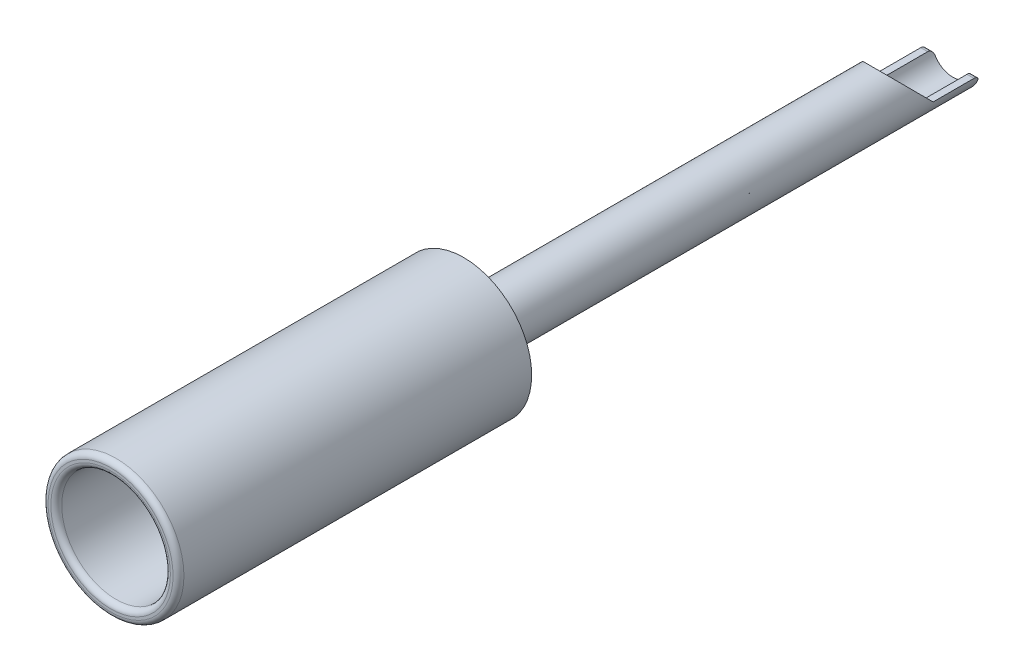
ISO-10303-21;
HEADER;
FILE_DESCRIPTION(('STEP AP214'),'2;1');
FILE_NAME('part.step','',(''),(''),'','','');
FILE_SCHEMA(('AUTOMOTIVE_DESIGN { 1 0 10303 214 1 1 1 1 }'));
ENDSEC;
DATA;
#1=APPLICATION_CONTEXT('core data for automotive mechanical design processes');
#2=APPLICATION_PROTOCOL_DEFINITION('international standard','automotive_design',2000,#1);
#3=PRODUCT_CONTEXT('',#1,'mechanical');
#4=PRODUCT('Part','Part','',(#3));
#5=PRODUCT_RELATED_PRODUCT_CATEGORY('part','',(#4));
#6=PRODUCT_DEFINITION_FORMATION('','',#4);
#7=PRODUCT_DEFINITION_CONTEXT('part definition',#1,'design');
#8=PRODUCT_DEFINITION('design','',#6,#7);
#9=PRODUCT_DEFINITION_SHAPE('','',#8);
#10=(LENGTH_UNIT() NAMED_UNIT(*) SI_UNIT(.MILLI.,.METRE.));
#11=(NAMED_UNIT(*) PLANE_ANGLE_UNIT() SI_UNIT($,.RADIAN.));
#12=(NAMED_UNIT(*) SI_UNIT($,.STERADIAN.) SOLID_ANGLE_UNIT());
#13=UNCERTAINTY_MEASURE_WITH_UNIT(LENGTH_MEASURE(1.E-05),#10,'distance_accuracy_value','');
#14=(GEOMETRIC_REPRESENTATION_CONTEXT(3) GLOBAL_UNCERTAINTY_ASSIGNED_CONTEXT((#13)) GLOBAL_UNIT_ASSIGNED_CONTEXT((#10,
#11,#12)) REPRESENTATION_CONTEXT('',''));
#15=CARTESIAN_POINT('',(0.,0.,0.));
#16=DIRECTION('',(0.,0.,1.));
#17=DIRECTION('',(1.,0.,0.));
#18=AXIS2_PLACEMENT_3D('',#15,#16,#17);
#19=CARTESIAN_POINT('',(0.,0.,0.));
#20=DIRECTION('',(0.,0.,-1.));
#21=DIRECTION('',(-1.,0.,0.));
#22=AXIS2_PLACEMENT_3D('',#19,#20,#21);
#23=CYLINDRICAL_SURFACE('',#22,0.5);
#24=CARTESIAN_POINT('',(0.,0.,-12.));
#25=DIRECTION('',(0.,0.,1.));
#26=DIRECTION('',(1.,0.,0.));
#27=AXIS2_PLACEMENT_3D('',#24,#25,#26);
#28=CIRCLE('',#27,0.5);
#29=CARTESIAN_POINT('',(0.5,0.,-12.));
#30=VERTEX_POINT('',#29);
#31=EDGE_CURVE('E118',#30,#30,#28,.T.);
#32=ORIENTED_EDGE('',*,*,#31,.T.);
#33=EDGE_LOOP('',(#32));
#34=FACE_BOUND('',#33,.T.);
#35=CARTESIAN_POINT('',(0.,0.,-28.));
#36=DIRECTION('',(0.,0.,-1.));
#37=DIRECTION('',(-1.,0.,0.));
#38=AXIS2_PLACEMENT_3D('',#35,#36,#37);
#39=CIRCLE('',#38,0.5);
#40=CARTESIAN_POINT('',(-0.5,0.,-28.));
#41=VERTEX_POINT('',#40);
#42=EDGE_CURVE('E115',#41,#41,#39,.F.);
#43=ORIENTED_EDGE('',*,*,#42,.F.);
#44=EDGE_LOOP('',(#43));
#45=FACE_BOUND('',#44,.T.);
#46=ADVANCED_FACE('F36',(#34,#45),#23,.F.);
#47=CARTESIAN_POINT('',(0.,0.,-31.));
#48=DIRECTION('',(0.,0.,1.));
#49=DIRECTION('',(1.,0.,0.));
#50=AXIS2_PLACEMENT_3D('',#47,#48,#49);
#51=CYLINDRICAL_SURFACE('',#50,2.5);
#52=CARTESIAN_POINT('',(0.,0.,-0.199999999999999));
#53=DIRECTION('',(0.,0.,1.));
#54=DIRECTION('',(1.,0.,0.));
#55=AXIS2_PLACEMENT_3D('',#52,#53,#54);
#56=CIRCLE('',#55,2.5);
#57=CARTESIAN_POINT('',(2.5,0.,-0.199999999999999));
#58=VERTEX_POINT('',#57);
#59=EDGE_CURVE('E141',#58,#58,#56,.F.);
#60=ORIENTED_EDGE('',*,*,#59,.T.);
#61=EDGE_LOOP('',(#60));
#62=FACE_BOUND('',#61,.T.);
#63=CARTESIAN_POINT('',(0.,0.,-13.));
#64=DIRECTION('',(0.,0.,-1.));
#65=DIRECTION('',(-1.,0.,0.));
#66=AXIS2_PLACEMENT_3D('',#63,#64,#65);
#67=CIRCLE('',#66,2.5);
#68=CARTESIAN_POINT('',(-2.5,0.,-13.));
#69=VERTEX_POINT('',#68);
#70=EDGE_CURVE('E125',#69,#69,#67,.F.);
#71=ORIENTED_EDGE('',*,*,#70,.T.);
#72=EDGE_LOOP('',(#71));
#73=FACE_BOUND('',#72,.T.);
#74=ADVANCED_FACE('F182',(#62,#73),#51,.T.);
#75=CARTESIAN_POINT('',(0.,0.,0.));
#76=DIRECTION('',(0.,0.,1.));
#77=DIRECTION('',(1.,0.,0.));
#78=AXIS2_PLACEMENT_3D('',#75,#76,#77);
#79=PLANE('',#78);
#80=CARTESIAN_POINT('',(0.,0.,0.));
#81=DIRECTION('',(0.,0.,1.));
#82=DIRECTION('',(1.,0.,0.));
#83=AXIS2_PLACEMENT_3D('',#80,#81,#82);
#84=CIRCLE('',#83,2.3);
#85=CARTESIAN_POINT('',(2.3,0.,0.));
#86=VERTEX_POINT('',#85);
#87=EDGE_CURVE('E138',#86,#86,#84,.T.);
#88=ORIENTED_EDGE('',*,*,#87,.T.);
#89=EDGE_LOOP('',(#88));
#90=FACE_BOUND('',#89,.T.);
#91=CARTESIAN_POINT('',(0.,0.,0.));
#92=DIRECTION('',(0.,0.,1.));
#93=DIRECTION('',(1.,0.,0.));
#94=AXIS2_PLACEMENT_3D('',#91,#92,#93);
#95=CIRCLE('',#94,2.2);
#96=CARTESIAN_POINT('',(2.2,0.,0.));
#97=VERTEX_POINT('',#96);
#98=EDGE_CURVE('E131',#97,#97,#95,.F.);
#99=ORIENTED_EDGE('',*,*,#98,.T.);
#100=EDGE_LOOP('',(#99));
#101=FACE_BOUND('',#100,.T.);
#102=ADVANCED_FACE('F214',(#90,#101),#79,.T.);
#103=CARTESIAN_POINT('',(0.,0.,-12.));
#104=DIRECTION('',(0.,0.,1.));
#105=DIRECTION('',(1.,0.,0.));
#106=AXIS2_PLACEMENT_3D('',#103,#104,#105);
#107=CYLINDRICAL_SURFACE('',#106,2.);
#108=CARTESIAN_POINT('',(0.,0.,-0.200000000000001));
#109=DIRECTION('',(0.,0.,1.));
#110=DIRECTION('',(1.,0.,0.));
#111=AXIS2_PLACEMENT_3D('',#108,#109,#110);
#112=CIRCLE('',#111,2.);
#113=CARTESIAN_POINT('',(2.,0.,-0.200000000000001));
#114=VERTEX_POINT('',#113);
#115=EDGE_CURVE('E144',#114,#114,#112,.T.);
#116=ORIENTED_EDGE('',*,*,#115,.T.);
#117=EDGE_LOOP('',(#116));
#118=FACE_BOUND('',#117,.T.);
#119=CARTESIAN_POINT('',(0.,0.,-12.));
#120=DIRECTION('',(0.,0.,1.));
#121=DIRECTION('',(1.,0.,0.));
#122=AXIS2_PLACEMENT_3D('',#119,#120,#121);
#123=CIRCLE('',#122,2.);
#124=CARTESIAN_POINT('',(2.,0.,-12.));
#125=VERTEX_POINT('',#124);
#126=EDGE_CURVE('E128',#125,#125,#123,.T.);
#127=ORIENTED_EDGE('',*,*,#126,.F.);
#128=EDGE_LOOP('',(#127));
#129=FACE_BOUND('',#128,.T.);
#130=ADVANCED_FACE('F218',(#118,#129),#107,.F.);
#131=CARTESIAN_POINT('',(0.,0.,-12.));
#132=DIRECTION('',(0.,0.,1.));
#133=DIRECTION('',(1.,0.,0.));
#134=AXIS2_PLACEMENT_3D('',#131,#132,#133);
#135=PLANE('',#134);
#136=ORIENTED_EDGE('',*,*,#31,.F.);
#137=EDGE_LOOP('',(#136));
#138=FACE_BOUND('',#137,.T.);
#139=ORIENTED_EDGE('',*,*,#126,.T.);
#140=EDGE_LOOP('',(#139));
#141=FACE_BOUND('',#140,.T.);
#142=ADVANCED_FACE('F224',(#138,#141),#135,.T.);
#143=CARTESIAN_POINT('',(0.,0.,-13.));
#144=DIRECTION('',(0.,0.,-1.));
#145=DIRECTION('',(-1.,0.,0.));
#146=AXIS2_PLACEMENT_3D('',#143,#144,#145);
#147=PLANE('',#146);
#148=ORIENTED_EDGE('',*,*,#70,.F.);
#149=EDGE_LOOP('',(#148));
#150=FACE_BOUND('',#149,.T.);
#151=CARTESIAN_POINT('',(0.,0.,-13.));
#152=DIRECTION('',(0.,0.,-1.));
#153=DIRECTION('',(-1.,0.,0.));
#154=AXIS2_PLACEMENT_3D('',#151,#152,#153);
#155=CIRCLE('',#154,1.);
#156=CARTESIAN_POINT('',(-1.,0.,-13.));
#157=VERTEX_POINT('',#156);
#158=EDGE_CURVE('E122',#157,#157,#155,.T.);
#159=ORIENTED_EDGE('',*,*,#158,.F.);
#160=EDGE_LOOP('',(#159));
#161=FACE_BOUND('',#160,.T.);
#162=ADVANCED_FACE('F188',(#150,#161),#147,.T.);
#163=CARTESIAN_POINT('',(0.,0.,-13.));
#164=DIRECTION('',(0.,0.,-1.));
#165=DIRECTION('',(-1.,0.,0.));
#166=AXIS2_PLACEMENT_3D('',#163,#164,#165);
#167=CYLINDRICAL_SURFACE('',#166,1.);
#168=DIRECTION('',(0.,0.,-1.));
#169=VECTOR('',#168,1.);
#170=CARTESIAN_POINT('',(-0.979795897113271,-0.2,-13.));
#171=LINE('',#170,#169);
#172=CARTESIAN_POINT('',(-0.979795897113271,-0.2,-30.8));
#173=VERTEX_POINT('',#172);
#174=CARTESIAN_POINT('',(-0.979795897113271,-0.2,-29.3));
#175=VERTEX_POINT('',#174);
#176=EDGE_CURVE('E89',#173,#175,#171,.F.);
#177=ORIENTED_EDGE('',*,*,#176,.F.);
#178=CARTESIAN_POINT('',(-0.979795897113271,-0.2,-30.8));
#179=CARTESIAN_POINT('',(-0.979792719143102,-0.199989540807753,-30.8110328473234));
#180=CARTESIAN_POINT('',(-0.979609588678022,-0.200912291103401,-30.822062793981));
#181=CARTESIAN_POINT('',(-0.97885983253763,-0.204547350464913,-30.8438000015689));
#182=CARTESIAN_POINT('',(-0.978293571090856,-0.207257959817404,-30.8545075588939));
#183=CARTESIAN_POINT('',(-0.976753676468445,-0.214393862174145,-30.8753102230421));
#184=CARTESIAN_POINT('',(-0.975779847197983,-0.218819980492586,-30.8854050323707));
#185=CARTESIAN_POINT('',(-0.973385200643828,-0.229237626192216,-30.9046911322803));
#186=CARTESIAN_POINT('',(-0.971964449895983,-0.235228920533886,-30.9138825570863));
#187=CARTESIAN_POINT('',(-0.968633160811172,-0.248590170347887,-30.9311268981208));
#188=CARTESIAN_POINT('',(-0.966721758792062,-0.255962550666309,-30.9391777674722));
#189=CARTESIAN_POINT('',(-0.962380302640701,-0.271830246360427,-30.9539147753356));
#190=CARTESIAN_POINT('',(-0.959950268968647,-0.280325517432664,-30.9606009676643));
#191=CARTESIAN_POINT('',(-0.954522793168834,-0.298287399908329,-30.9725473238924));
#192=CARTESIAN_POINT('',(-0.951517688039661,-0.307766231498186,-30.9777855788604));
#193=CARTESIAN_POINT('',(-0.944978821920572,-0.327293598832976,-30.9866245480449));
#194=CARTESIAN_POINT('',(-0.941444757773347,-0.337342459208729,-30.9902243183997));
#195=CARTESIAN_POINT('',(-0.934458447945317,-0.356191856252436,-30.9953499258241));
#196=CARTESIAN_POINT('',(-0.931072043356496,-0.364956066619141,-30.9971044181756));
#197=CARTESIAN_POINT('',(-0.924004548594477,-0.382500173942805,-30.9994295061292));
#198=CARTESIAN_POINT('',(-0.920324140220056,-0.391279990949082,-31.0000027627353));
#199=CARTESIAN_POINT('',(-0.916515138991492,-0.400000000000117,-31.));
#200=B_SPLINE_CURVE_WITH_KNOTS('',3,(#178,#179,#180,#181,#182,#183,#184,#185,#186,#187,#188,
#189,#190,#191,#192,#193,#194,#195,#196,#197,#198,#199),.UNSPECIFIED.,.F.,.F.,(4,2,2,2,2,2,2,2,
2,2,4),(0.,0.0330543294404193,0.0660772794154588,0.0991161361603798,0.132150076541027,
0.165242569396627,0.19833375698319,0.231901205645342,0.265487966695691,0.294085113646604,
0.32261776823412),.UNSPECIFIED.);
#201=CARTESIAN_POINT('',(-0.916515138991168,-0.4,-31.));
#202=VERTEX_POINT('',#201);
#203=EDGE_CURVE('E45',#173,#202,#200,.T.);
#204=ORIENTED_EDGE('',*,*,#203,.T.);
#205=CARTESIAN_POINT('',(0.,0.,-31.));
#206=DIRECTION('',(0.,0.,-1.));
#207=DIRECTION('',(-1.,0.,0.));
#208=AXIS2_PLACEMENT_3D('',#205,#206,#207);
#209=CIRCLE('',#208,1.);
#210=CARTESIAN_POINT('',(0.916515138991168,-0.4,-31.));
#211=VERTEX_POINT('',#210);
#212=EDGE_CURVE('E121',#211,#202,#209,.T.);
#213=ORIENTED_EDGE('',*,*,#212,.F.);
#214=CARTESIAN_POINT('',(0.916515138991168,-0.4,-31.));
#215=CARTESIAN_POINT('',(0.921407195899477,-0.388812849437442,-31.0000102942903));
#216=CARTESIAN_POINT('',(0.926083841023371,-0.377516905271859,-30.9990611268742));
#217=CARTESIAN_POINT('',(0.934929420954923,-0.355033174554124,-30.9952109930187));
#218=CARTESIAN_POINT('',(0.939097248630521,-0.343845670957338,-30.9923058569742));
#219=CARTESIAN_POINT('',(0.946837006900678,-0.321926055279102,-30.9845001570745));
#220=CARTESIAN_POINT('',(0.950407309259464,-0.311195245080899,-30.9795942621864));
#221=CARTESIAN_POINT('',(0.956894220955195,-0.290636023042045,-30.9678667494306));
#222=CARTESIAN_POINT('',(0.959811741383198,-0.28080636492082,-30.9610478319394));
#223=CARTESIAN_POINT('',(0.964850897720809,-0.26295275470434,-30.9461020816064));
#224=CARTESIAN_POINT('',(0.96700846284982,-0.254857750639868,-30.9380721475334));
#225=CARTESIAN_POINT('',(0.970778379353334,-0.24009896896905,-30.9206721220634));
#226=CARTESIAN_POINT('',(0.972390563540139,-0.233435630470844,-30.9113016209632));
#227=CARTESIAN_POINT('',(0.975063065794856,-0.222003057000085,-30.8918674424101));
#228=CARTESIAN_POINT('',(0.976141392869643,-0.217173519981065,-30.8818415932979));
#229=CARTESIAN_POINT('',(0.977873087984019,-0.209238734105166,-30.8610996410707));
#230=CARTESIAN_POINT('',(0.978526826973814,-0.206131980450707,-30.8503841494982));
#231=CARTESIAN_POINT('',(0.979256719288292,-0.202627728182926,-30.832988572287));
#232=CARTESIAN_POINT('',(0.979459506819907,-0.201642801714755,-30.8264262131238));
#233=CARTESIAN_POINT('',(0.979728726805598,-0.200329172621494,-30.8132435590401));
#234=CARTESIAN_POINT('',(0.979795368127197,-0.199999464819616,-30.8066233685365));
#235=CARTESIAN_POINT('',(0.979795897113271,-0.2,-30.8));
#236=B_SPLINE_CURVE_WITH_KNOTS('',3,(#214,#215,#216,#217,#218,#219,#220,#221,#222,#223,#224,
#225,#226,#227,#228,#229,#230,#231,#232,#233,#234,#235),.UNSPECIFIED.,.F.,.F.,(4,2,2,2,2,2,2,2,
2,2,4),(0.,0.0366112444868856,0.0733007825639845,0.110088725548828,0.146824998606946,
0.181463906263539,0.216113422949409,0.249497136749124,0.282851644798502,0.302737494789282,
0.32259281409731),.UNSPECIFIED.);
#237=CARTESIAN_POINT('',(0.979795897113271,-0.2,-30.8));
#238=VERTEX_POINT('',#237);
#239=EDGE_CURVE('E52',#211,#238,#236,.T.);
#240=ORIENTED_EDGE('',*,*,#239,.T.);
#241=DIRECTION('',(0.,0.,-1.));
#242=VECTOR('',#241,1.);
#243=CARTESIAN_POINT('',(0.979795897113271,-0.2,-13.));
#244=LINE('',#243,#242);
#245=CARTESIAN_POINT('',(0.979795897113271,-0.2,-29.3));
#246=VERTEX_POINT('',#245);
#247=EDGE_CURVE('E96',#246,#238,#244,.T.);
#248=ORIENTED_EDGE('',*,*,#247,.F.);
#249=CARTESIAN_POINT('',(0.,0.,-29.1));
#250=DIRECTION('',(0.,-0.707106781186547,0.707106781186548));
#251=DIRECTION('',(0.,-0.707106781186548,-0.707106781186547));
#252=AXIS2_PLACEMENT_3D('',#249,#250,#251);
#253=ELLIPSE('',#252,1.41421356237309,1.);
#254=EDGE_CURVE('E101',#175,#246,#253,.F.);
#255=ORIENTED_EDGE('',*,*,#254,.F.);
#256=EDGE_LOOP('',(#177,#204,#213,#240,#248,#255));
#257=FACE_BOUND('',#256,.T.);
#258=ORIENTED_EDGE('',*,*,#158,.T.);
#259=EDGE_LOOP('',(#258));
#260=FACE_BOUND('',#259,.T.);
#261=ADVANCED_FACE('F107',(#257,#260),#167,.T.);
#262=CARTESIAN_POINT('',(0.,0.,-31.));
#263=DIRECTION('',(0.,0.,1.));
#264=DIRECTION('',(1.,0.,0.));
#265=AXIS2_PLACEMENT_3D('',#262,#263,#264);
#266=PLANE('',#265);
#267=ORIENTED_EDGE('',*,*,#212,.T.);
#268=DIRECTION('',(1.,0.,0.));
#269=VECTOR('',#268,1.);
#270=CARTESIAN_POINT('',(0.,-0.4,-31.));
#271=LINE('',#270,#269);
#272=CARTESIAN_POINT('',(-0.634428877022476,-0.4,-31.));
#273=VERTEX_POINT('',#272);
#274=EDGE_CURVE('E156',#202,#273,#271,.T.);
#275=ORIENTED_EDGE('',*,*,#274,.T.);
#276=CARTESIAN_POINT('',(0.,0.,-31.));
#277=DIRECTION('',(0.,0.,-1.));
#278=DIRECTION('',(-1.,0.,0.));
#279=AXIS2_PLACEMENT_3D('',#276,#277,#278);
#280=CIRCLE('',#279,0.75);
#281=CARTESIAN_POINT('',(0.634428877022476,-0.4,-31.));
#282=VERTEX_POINT('',#281);
#283=EDGE_CURVE('E95',#282,#273,#280,.T.);
#284=ORIENTED_EDGE('',*,*,#283,.F.);
#285=DIRECTION('',(1.,0.,0.));
#286=VECTOR('',#285,1.);
#287=CARTESIAN_POINT('',(0.,-0.4,-31.));
#288=LINE('',#287,#286);
#289=EDGE_CURVE('E153',#282,#211,#288,.T.);
#290=ORIENTED_EDGE('',*,*,#289,.T.);
#291=EDGE_LOOP('',(#267,#275,#284,#290));
#292=FACE_BOUND('',#291,.T.);
#293=ADVANCED_FACE('F187',(#292),#266,.F.);
#294=CARTESIAN_POINT('',(0.,0.,-28.));
#295=DIRECTION('',(0.,0.,-1.));
#296=DIRECTION('',(-1.,0.,0.));
#297=AXIS2_PLACEMENT_3D('',#294,#295,#296);
#298=PLANE('',#297);
#299=CARTESIAN_POINT('',(0.,0.,-28.));
#300=DIRECTION('',(0.,0.,-1.));
#301=DIRECTION('',(-1.,0.,0.));
#302=AXIS2_PLACEMENT_3D('',#299,#300,#301);
#303=CIRCLE('',#302,0.75);
#304=CARTESIAN_POINT('',(-0.75,0.,-28.));
#305=VERTEX_POINT('',#304);
#306=EDGE_CURVE('E112',#305,#305,#303,.T.);
#307=ORIENTED_EDGE('',*,*,#306,.T.);
#308=EDGE_LOOP('',(#307));
#309=FACE_BOUND('',#308,.T.);
#310=ORIENTED_EDGE('',*,*,#42,.T.);
#311=EDGE_LOOP('',(#310));
#312=FACE_BOUND('',#311,.T.);
#313=ADVANCED_FACE('F176',(#309,#312),#298,.T.);
#314=CARTESIAN_POINT('',(0.,0.,-28.));
#315=DIRECTION('',(0.,0.,-1.));
#316=DIRECTION('',(-1.,0.,0.));
#317=AXIS2_PLACEMENT_3D('',#314,#315,#316);
#318=CYLINDRICAL_SURFACE('',#317,0.75);
#319=ORIENTED_EDGE('',*,*,#283,.T.);
#320=CARTESIAN_POINT('',(-0.634428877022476,-0.4,-31.));
#321=CARTESIAN_POINT('',(-0.641446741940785,-0.388895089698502,-31.0000103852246));
#322=CARTESIAN_POINT('',(-0.648165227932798,-0.377566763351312,-30.9990740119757));
#323=CARTESIAN_POINT('',(-0.660898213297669,-0.354794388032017,-30.9951657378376));
#324=CARTESIAN_POINT('',(-0.666909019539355,-0.343350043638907,-30.9921836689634));
#325=CARTESIAN_POINT('',(-0.678074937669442,-0.320741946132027,-30.9840197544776));
#326=CARTESIAN_POINT('',(-0.683225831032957,-0.309579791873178,-30.9788274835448));
#327=CARTESIAN_POINT('',(-0.692539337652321,-0.28814105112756,-30.966256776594));
#328=CARTESIAN_POINT('',(-0.696704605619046,-0.277862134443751,-30.9588843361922));
#329=CARTESIAN_POINT('',(-0.703641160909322,-0.259755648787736,-30.943038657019));
#330=CARTESIAN_POINT('',(-0.706515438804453,-0.251782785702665,-30.9347760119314));
#331=CARTESIAN_POINT('',(-0.71151642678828,-0.237283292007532,-30.9168588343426));
#332=CARTESIAN_POINT('',(-0.713642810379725,-0.230757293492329,-30.9072036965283));
#333=CARTESIAN_POINT('',(-0.71708727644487,-0.21981072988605,-30.887469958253));
#334=CARTESIAN_POINT('',(-0.718448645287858,-0.215281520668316,-30.8774588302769));
#335=CARTESIAN_POINT('',(-0.720614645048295,-0.207916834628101,-30.8567817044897));
#336=CARTESIAN_POINT('',(-0.721419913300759,-0.205079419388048,-30.8461164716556));
#337=CARTESIAN_POINT('',(-0.722259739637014,-0.202093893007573,-30.8294667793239));
#338=CARTESIAN_POINT('',(-0.722478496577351,-0.201308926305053,-30.8235982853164));
#339=CARTESIAN_POINT('',(-0.722769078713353,-0.20026229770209,-30.8118207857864));
#340=CARTESIAN_POINT('',(-0.722841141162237,-0.199999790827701,-30.8059118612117));
#341=CARTESIAN_POINT('',(-0.722841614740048,-0.2,-30.8));
#342=B_SPLINE_CURVE_WITH_KNOTS('',3,(#320,#321,#322,#323,#324,#325,#326,#327,#328,#329,#330,
#331,#332,#333,#334,#335,#336,#337,#338,#339,#340,#341),.UNSPECIFIED.,.F.,.F.,(4,2,2,2,2,2,2,2,
2,2,4),(0.,0.0394155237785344,0.0790283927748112,0.118830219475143,0.158523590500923,
0.193846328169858,0.229184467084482,0.262243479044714,0.295264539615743,0.313016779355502,
0.330740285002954),.UNSPECIFIED.);
#343=CARTESIAN_POINT('',(-0.722841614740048,-0.2,-30.8));
#344=VERTEX_POINT('',#343);
#345=EDGE_CURVE('E165',#273,#344,#342,.T.);
#346=ORIENTED_EDGE('',*,*,#345,.T.);
#347=DIRECTION('',(0.,0.,-1.));
#348=VECTOR('',#347,1.);
#349=CARTESIAN_POINT('',(-0.722841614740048,-0.2,-28.));
#350=LINE('',#349,#348);
#351=CARTESIAN_POINT('',(-0.722841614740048,-0.2,-29.3));
#352=VERTEX_POINT('',#351);
#353=EDGE_CURVE('E151',#344,#352,#350,.F.);
#354=ORIENTED_EDGE('',*,*,#353,.T.);
#355=CARTESIAN_POINT('',(0.,0.,-29.1));
#356=DIRECTION('',(0.,-0.707106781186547,0.707106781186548));
#357=DIRECTION('',(0.,-0.707106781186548,-0.707106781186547));
#358=AXIS2_PLACEMENT_3D('',#355,#356,#357);
#359=ELLIPSE('',#358,1.06066017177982,0.75);
#360=CARTESIAN_POINT('',(0.722841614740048,-0.2,-29.3));
#361=VERTEX_POINT('',#360);
#362=EDGE_CURVE('E104',#352,#361,#359,.F.);
#363=ORIENTED_EDGE('',*,*,#362,.T.);
#364=DIRECTION('',(0.,0.,-1.));
#365=VECTOR('',#364,1.);
#366=CARTESIAN_POINT('',(0.722841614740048,-0.2,-28.));
#367=LINE('',#366,#365);
#368=CARTESIAN_POINT('',(0.722841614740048,-0.2,-30.8));
#369=VERTEX_POINT('',#368);
#370=EDGE_CURVE('E148',#361,#369,#367,.T.);
#371=ORIENTED_EDGE('',*,*,#370,.T.);
#372=CARTESIAN_POINT('',(0.722841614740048,-0.2,-30.8));
#373=CARTESIAN_POINT('',(0.722837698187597,-0.199988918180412,-30.8108595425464));
#374=CARTESIAN_POINT('',(0.722596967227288,-0.20088379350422,-30.8217161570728));
#375=CARTESIAN_POINT('',(0.721612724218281,-0.20440420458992,-30.843110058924));
#376=CARTESIAN_POINT('',(0.720869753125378,-0.207027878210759,-30.8536476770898));
#377=CARTESIAN_POINT('',(0.718851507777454,-0.213926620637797,-30.874119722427));
#378=CARTESIAN_POINT('',(0.717575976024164,-0.218202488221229,-30.8840538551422));
#379=CARTESIAN_POINT('',(0.714444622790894,-0.228246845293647,-30.9030341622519));
#380=CARTESIAN_POINT('',(0.712588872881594,-0.234015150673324,-30.9120804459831));
#381=CARTESIAN_POINT('',(0.708244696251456,-0.246850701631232,-30.9290697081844));
#382=CARTESIAN_POINT('',(0.705754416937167,-0.253921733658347,-30.9370093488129));
#383=CARTESIAN_POINT('',(0.700113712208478,-0.269083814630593,-30.9515631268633));
#384=CARTESIAN_POINT('',(0.69696342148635,-0.277174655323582,-30.9581775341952));
#385=CARTESIAN_POINT('',(0.689914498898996,-0.294288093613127,-30.9701070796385));
#386=CARTESIAN_POINT('',(0.685999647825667,-0.303328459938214,-30.9753870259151));
#387=CARTESIAN_POINT('',(0.677499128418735,-0.321868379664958,-30.9843960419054));
#388=CARTESIAN_POINT('',(0.672912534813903,-0.331368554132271,-30.9881229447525));
#389=CARTESIAN_POINT('',(0.662992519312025,-0.350802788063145,-30.9941289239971));
#390=CARTESIAN_POINT('',(0.657641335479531,-0.360741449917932,-30.9963630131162));
#391=CARTESIAN_POINT('',(0.64641013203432,-0.380507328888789,-30.9992988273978));
#392=CARTESIAN_POINT('',(0.640531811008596,-0.390334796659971,-31.0000053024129));
#393=CARTESIAN_POINT('',(0.634428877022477,-0.4,-31.));
#394=B_SPLINE_CURVE_WITH_KNOTS('',3,(#372,#373,#374,#375,#376,#377,#378,#379,#380,#381,#382,
#383,#384,#385,#386,#387,#388,#389,#390,#391,#392,#393),.UNSPECIFIED.,.F.,.F.,(4,2,2,2,2,2,2,2,
2,2,4),(0.,0.0325349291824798,0.0650348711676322,0.0975505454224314,0.130062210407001,
0.162669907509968,0.195270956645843,0.22865845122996,0.262092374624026,0.296493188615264,
0.330786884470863),.UNSPECIFIED.);
#395=EDGE_CURVE('E159',#369,#282,#394,.T.);
#396=ORIENTED_EDGE('',*,*,#395,.T.);
#397=EDGE_LOOP('',(#319,#346,#354,#363,#371,#396));
#398=FACE_BOUND('',#397,.T.);
#399=ORIENTED_EDGE('',*,*,#306,.F.);
#400=EDGE_LOOP('',(#399));
#401=FACE_BOUND('',#400,.T.);
#402=ADVANCED_FACE('F170',(#398,#401),#318,.F.);
#403=CARTESIAN_POINT('',(0.,0.,-0.199999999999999));
#404=DIRECTION('',(0.,0.,1.));
#405=DIRECTION('',(1.,0.,0.));
#406=AXIS2_PLACEMENT_3D('',#403,#404,#405);
#407=TOROIDAL_SURFACE('',#406,2.3,0.2);
#408=ORIENTED_EDGE('',*,*,#59,.F.);
#409=EDGE_LOOP('',(#408));
#410=FACE_BOUND('',#409,.T.);
#411=ORIENTED_EDGE('',*,*,#87,.F.);
#412=EDGE_LOOP('',(#411));
#413=FACE_BOUND('',#412,.T.);
#414=ADVANCED_FACE('F175',(#410,#413),#407,.T.);
#415=CARTESIAN_POINT('',(0.,0.,-0.200000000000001));
#416=DIRECTION('',(0.,0.,1.));
#417=DIRECTION('',(1.,0.,0.));
#418=AXIS2_PLACEMENT_3D('',#415,#416,#417);
#419=TOROIDAL_SURFACE('',#418,2.2,0.2);
#420=ORIENTED_EDGE('',*,*,#98,.F.);
#421=EDGE_LOOP('',(#420));
#422=FACE_BOUND('',#421,.T.);
#423=ORIENTED_EDGE('',*,*,#115,.F.);
#424=EDGE_LOOP('',(#423));
#425=FACE_BOUND('',#424,.T.);
#426=ADVANCED_FACE('F204',(#422,#425),#419,.T.);
#427=CARTESIAN_POINT('',(-1.5,-0.2,-29.3));
#428=DIRECTION('',(0.,-1.,0.));
#429=DIRECTION('',(0.,0.,-1.));
#430=AXIS2_PLACEMENT_3D('',#427,#428,#429);
#431=PLANE('',#430);
#432=ORIENTED_EDGE('',*,*,#353,.F.);
#433=DIRECTION('',(1.,0.,0.));
#434=VECTOR('',#433,1.);
#435=CARTESIAN_POINT('',(-1.5,-0.2,-30.8));
#436=LINE('',#435,#434);
#437=EDGE_CURVE('E60',#344,#173,#436,.F.);
#438=ORIENTED_EDGE('',*,*,#437,.T.);
#439=ORIENTED_EDGE('',*,*,#176,.T.);
#440=DIRECTION('',(1.,0.,0.));
#441=VECTOR('',#440,1.);
#442=CARTESIAN_POINT('',(-1.5,-0.2,-29.3));
#443=LINE('',#442,#441);
#444=EDGE_CURVE('E92',#175,#352,#443,.T.);
#445=ORIENTED_EDGE('',*,*,#444,.T.);
#446=EDGE_LOOP('',(#432,#438,#439,#445));
#447=FACE_BOUND('',#446,.T.);
#448=ADVANCED_FACE('F91',(#447),#431,.F.);
#449=CARTESIAN_POINT('',(-1.5,1.8,-27.3));
#450=DIRECTION('',(0.,-0.707106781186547,0.707106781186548));
#451=DIRECTION('',(0.,-0.707106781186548,-0.707106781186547));
#452=AXIS2_PLACEMENT_3D('',#449,#450,#451);
#453=PLANE('',#452);
#454=ORIENTED_EDGE('',*,*,#254,.T.);
#455=EDGE_CURVE('E105',#361,#246,#443,.T.);
#456=ORIENTED_EDGE('',*,*,#455,.F.);
#457=ORIENTED_EDGE('',*,*,#362,.F.);
#458=ORIENTED_EDGE('',*,*,#444,.F.);
#459=EDGE_LOOP('',(#454,#456,#457,#458));
#460=FACE_BOUND('',#459,.T.);
#461=ADVANCED_FACE('F100',(#460),#453,.F.);
#462=ORIENTED_EDGE('',*,*,#247,.T.);
#463=DIRECTION('',(1.,0.,0.));
#464=VECTOR('',#463,1.);
#465=CARTESIAN_POINT('',(-1.5,-0.2,-30.8));
#466=LINE('',#465,#464);
#467=EDGE_CURVE('E12',#238,#369,#466,.F.);
#468=ORIENTED_EDGE('',*,*,#467,.T.);
#469=ORIENTED_EDGE('',*,*,#370,.F.);
#470=ORIENTED_EDGE('',*,*,#455,.T.);
#471=EDGE_LOOP('',(#462,#468,#469,#470));
#472=FACE_BOUND('',#471,.T.);
#473=ADVANCED_FACE('F202',(#472),#431,.F.);
#474=CARTESIAN_POINT('',(0.,-0.4,-30.8));
#475=DIRECTION('',(1.,0.,0.));
#476=DIRECTION('',(0.,0.,-1.));
#477=AXIS2_PLACEMENT_3D('',#474,#475,#476);
#478=CYLINDRICAL_SURFACE('',#477,0.2);
#479=ORIENTED_EDGE('',*,*,#203,.F.);
#480=ORIENTED_EDGE('',*,*,#437,.F.);
#481=ORIENTED_EDGE('',*,*,#345,.F.);
#482=ORIENTED_EDGE('',*,*,#274,.F.);
#483=EDGE_LOOP('',(#479,#480,#481,#482));
#484=FACE_BOUND('',#483,.T.);
#485=ADVANCED_FACE('F198',(#484),#478,.T.);
#486=CARTESIAN_POINT('',(0.,-0.4,-30.8));
#487=DIRECTION('',(1.,0.,0.));
#488=DIRECTION('',(0.,0.,-1.));
#489=AXIS2_PLACEMENT_3D('',#486,#487,#488);
#490=CYLINDRICAL_SURFACE('',#489,0.2);
#491=ORIENTED_EDGE('',*,*,#395,.F.);
#492=ORIENTED_EDGE('',*,*,#467,.F.);
#493=ORIENTED_EDGE('',*,*,#239,.F.);
#494=ORIENTED_EDGE('',*,*,#289,.F.);
#495=EDGE_LOOP('',(#491,#492,#493,#494));
#496=FACE_BOUND('',#495,.T.);
#497=ADVANCED_FACE('F38',(#496),#490,.T.);
#498=CLOSED_SHELL('',(#46,#74,#102,#130,#142,#162,#261,#293,#313,#402,#414,#426,#448,#461,#473,
#485,#497));
#499=MANIFOLD_SOLID_BREP('B2',#498);
#500=ADVANCED_BREP_SHAPE_REPRESENTATION('',(#18,#499),#14);
#501=SHAPE_DEFINITION_REPRESENTATION(#9,#500);
ENDSEC;
END-ISO-10303-21;
